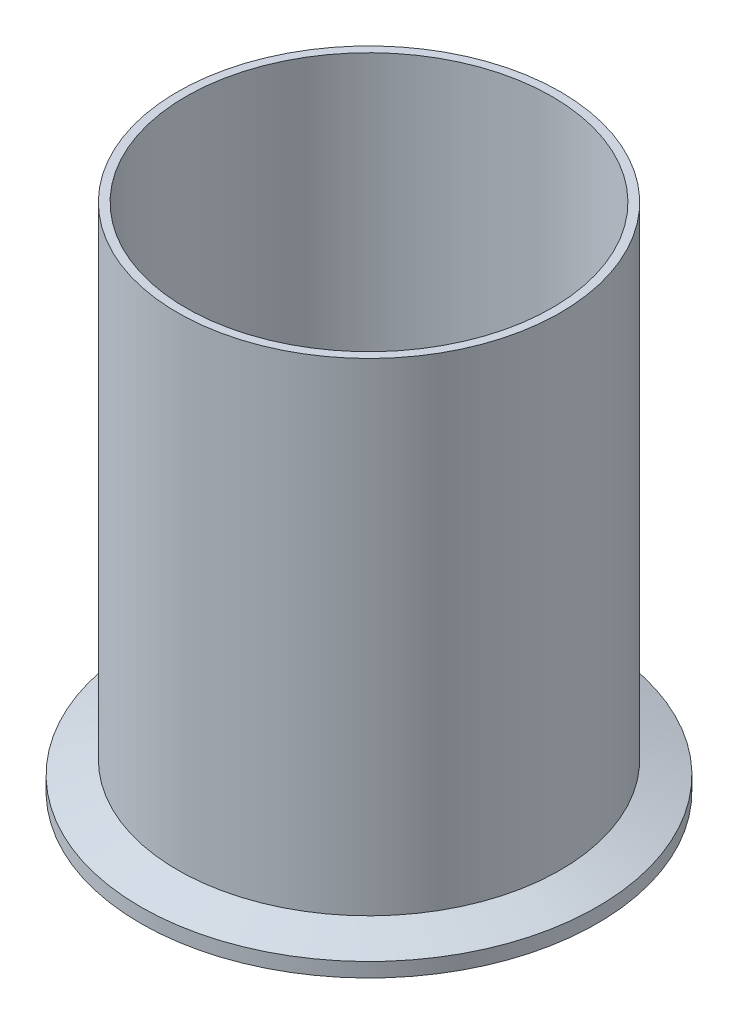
ISO-10303-21;
HEADER;
FILE_DESCRIPTION(('STEP AP214'),'2;1');
FILE_NAME('part.step','',(''),(''),'','','');
FILE_SCHEMA(('AUTOMOTIVE_DESIGN { 1 0 10303 214 1 1 1 1 }'));
ENDSEC;
DATA;
#1=APPLICATION_CONTEXT('core data for automotive mechanical design processes');
#2=APPLICATION_PROTOCOL_DEFINITION('international standard','automotive_design',2000,#1);
#3=PRODUCT_CONTEXT('',#1,'mechanical');
#4=PRODUCT('Part','Part','',(#3));
#5=PRODUCT_RELATED_PRODUCT_CATEGORY('part','',(#4));
#6=PRODUCT_DEFINITION_FORMATION('','',#4);
#7=PRODUCT_DEFINITION_CONTEXT('part definition',#1,'design');
#8=PRODUCT_DEFINITION('design','',#6,#7);
#9=PRODUCT_DEFINITION_SHAPE('','',#8);
#10=(LENGTH_UNIT() NAMED_UNIT(*) SI_UNIT(.MILLI.,.METRE.));
#11=(NAMED_UNIT(*) PLANE_ANGLE_UNIT() SI_UNIT($,.RADIAN.));
#12=(NAMED_UNIT(*) SI_UNIT($,.STERADIAN.) SOLID_ANGLE_UNIT());
#13=UNCERTAINTY_MEASURE_WITH_UNIT(LENGTH_MEASURE(1.E-05),#10,'distance_accuracy_value','');
#14=(GEOMETRIC_REPRESENTATION_CONTEXT(3) GLOBAL_UNCERTAINTY_ASSIGNED_CONTEXT((#13)) GLOBAL_UNIT_ASSIGNED_CONTEXT((#10,
#11,#12)) REPRESENTATION_CONTEXT('',''));
#15=CARTESIAN_POINT('',(0.,0.,0.));
#16=DIRECTION('',(0.,0.,1.));
#17=DIRECTION('',(1.,0.,0.));
#18=AXIS2_PLACEMENT_3D('',#15,#16,#17);
#19=CARTESIAN_POINT('',(0.,0.7874,0.));
#20=DIRECTION('',(0.,-1.,0.));
#21=DIRECTION('',(0.,0.,-1.));
#22=AXIS2_PLACEMENT_3D('',#19,#20,#21);
#23=TOROIDAL_SURFACE('',#22,43.4867084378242,0.787400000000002);
#24=CARTESIAN_POINT('',(0.,0.,0.));
#25=DIRECTION('',(0.,-1.,0.));
#26=DIRECTION('',(0.,0.,-1.));
#27=AXIS2_PLACEMENT_3D('',#24,#25,#26);
#28=CIRCLE('',#27,43.4867084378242);
#29=CARTESIAN_POINT('',(0.,0.,-43.4867084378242));
#30=VERTEX_POINT('',#29);
#31=EDGE_CURVE('E67',#30,#30,#28,.T.);
#32=ORIENTED_EDGE('',*,*,#31,.T.);
#33=EDGE_LOOP('',(#32));
#34=FACE_BOUND('',#33,.T.);
#35=CARTESIAN_POINT('',(0.,0.474458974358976,0.));
#36=DIRECTION('',(0.,-1.,0.));
#37=DIRECTION('',(0.,0.,-1.));
#38=AXIS2_PLACEMENT_3D('',#35,#36,#37);
#39=CIRCLE('',#38,42.7641666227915);
#40=CARTESIAN_POINT('',(0.,0.474458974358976,-42.7641666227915));
#41=VERTEX_POINT('',#40);
#42=EDGE_CURVE('E10',#41,#41,#39,.T.);
#43=ORIENTED_EDGE('',*,*,#42,.F.);
#44=EDGE_LOOP('',(#43));
#45=FACE_BOUND('',#44,.T.);
#46=ADVANCED_FACE('F33',(#34,#45),#23,.T.);
#47=CARTESIAN_POINT('',(0.,0.,0.));
#48=DIRECTION('',(0.,-1.,0.));
#49=DIRECTION('',(0.,0.,-1.));
#50=AXIS2_PLACEMENT_3D('',#47,#48,#49);
#51=TOROIDAL_SURFACE('',#50,41.6687,1.1938);
#52=CARTESIAN_POINT('',(0.,0.474458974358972,0.));
#53=DIRECTION('',(0.,-1.,0.));
#54=DIRECTION('',(0.,0.,-1.));
#55=AXIS2_PLACEMENT_3D('',#52,#53,#54);
#56=CIRCLE('',#55,40.5732333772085);
#57=CARTESIAN_POINT('',(0.,0.474458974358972,-40.5732333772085));
#58=VERTEX_POINT('',#57);
#59=EDGE_CURVE('E39',#58,#58,#56,.T.);
#60=ORIENTED_EDGE('',*,*,#59,.F.);
#61=EDGE_LOOP('',(#60));
#62=FACE_BOUND('',#61,.T.);
#63=ORIENTED_EDGE('',*,*,#42,.T.);
#64=EDGE_LOOP('',(#63));
#65=FACE_BOUND('',#64,.T.);
#66=ADVANCED_FACE('F115',(#62,#65),#51,.F.);
#67=CARTESIAN_POINT('',(0.,0.7874,0.));
#68=DIRECTION('',(0.,-1.,0.));
#69=DIRECTION('',(0.,0.,-1.));
#70=AXIS2_PLACEMENT_3D('',#67,#68,#69);
#71=TOROIDAL_SURFACE('',#70,39.8506915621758,0.787399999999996);
#72=ORIENTED_EDGE('',*,*,#59,.T.);
#73=EDGE_LOOP('',(#72));
#74=FACE_BOUND('',#73,.T.);
#75=CARTESIAN_POINT('',(0.,0.,0.));
#76=DIRECTION('',(0.,-1.,0.));
#77=DIRECTION('',(0.,0.,-1.));
#78=AXIS2_PLACEMENT_3D('',#75,#76,#77);
#79=CIRCLE('',#78,39.8506915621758);
#80=CARTESIAN_POINT('',(0.,0.,-39.8506915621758));
#81=VERTEX_POINT('',#80);
#82=EDGE_CURVE('E43',#81,#81,#79,.T.);
#83=ORIENTED_EDGE('',*,*,#82,.F.);
#84=EDGE_LOOP('',(#83));
#85=FACE_BOUND('',#84,.T.);
#86=ADVANCED_FACE('F111',(#74,#85),#71,.T.);
#87=CARTESIAN_POINT('',(0.,0.,0.));
#88=DIRECTION('',(0.,1.,0.));
#89=DIRECTION('',(0.,0.,1.));
#90=AXIS2_PLACEMENT_3D('',#87,#88,#89);
#91=PLANE('',#90);
#92=CARTESIAN_POINT('',(0.,0.,0.));
#93=DIRECTION('',(0.,-1.,0.));
#94=DIRECTION('',(0.,0.,-1.));
#95=AXIS2_PLACEMENT_3D('',#92,#93,#94);
#96=CIRCLE('',#95,36.449);
#97=CARTESIAN_POINT('',(0.,0.,-36.449));
#98=VERTEX_POINT('',#97);
#99=EDGE_CURVE('E47',#98,#98,#96,.T.);
#100=ORIENTED_EDGE('',*,*,#99,.F.);
#101=EDGE_LOOP('',(#100));
#102=FACE_BOUND('',#101,.T.);
#103=ORIENTED_EDGE('',*,*,#82,.T.);
#104=EDGE_LOOP('',(#103));
#105=FACE_BOUND('',#104,.T.);
#106=ADVANCED_FACE('F105',(#102,#105),#91,.F.);
#107=CARTESIAN_POINT('',(0.,0.,0.));
#108=DIRECTION('',(0.,-1.,0.));
#109=DIRECTION('',(0.,0.,-1.));
#110=AXIS2_PLACEMENT_3D('',#107,#108,#109);
#111=CYLINDRICAL_SURFACE('',#110,36.449);
#112=ORIENTED_EDGE('',*,*,#99,.T.);
#113=EDGE_LOOP('',(#112));
#114=FACE_BOUND('',#113,.T.);
#115=CARTESIAN_POINT('',(0.,101.6,0.));
#116=DIRECTION('',(0.,-1.,0.));
#117=DIRECTION('',(0.,0.,-1.));
#118=AXIS2_PLACEMENT_3D('',#115,#116,#117);
#119=CIRCLE('',#118,36.449);
#120=CARTESIAN_POINT('',(0.,101.6,-36.449));
#121=VERTEX_POINT('',#120);
#122=EDGE_CURVE('E52',#121,#121,#119,.T.);
#123=ORIENTED_EDGE('',*,*,#122,.F.);
#124=EDGE_LOOP('',(#123));
#125=FACE_BOUND('',#124,.T.);
#126=ADVANCED_FACE('F100',(#114,#125),#111,.F.);
#127=CARTESIAN_POINT('',(0.,101.6,0.));
#128=DIRECTION('',(0.,-1.,0.));
#129=DIRECTION('',(0.,0.,-1.));
#130=AXIS2_PLACEMENT_3D('',#127,#128,#129);
#131=PLANE('',#130);
#132=CARTESIAN_POINT('',(0.,101.6,0.));
#133=DIRECTION('',(0.,-1.,0.));
#134=DIRECTION('',(0.,0.,-1.));
#135=AXIS2_PLACEMENT_3D('',#132,#133,#134);
#136=CIRCLE('',#135,38.1);
#137=CARTESIAN_POINT('',(0.,101.6,-38.1));
#138=VERTEX_POINT('',#137);
#139=EDGE_CURVE('E55',#138,#138,#136,.T.);
#140=ORIENTED_EDGE('',*,*,#139,.F.);
#141=EDGE_LOOP('',(#140));
#142=FACE_BOUND('',#141,.T.);
#143=ORIENTED_EDGE('',*,*,#122,.T.);
#144=EDGE_LOOP('',(#143));
#145=FACE_BOUND('',#144,.T.);
#146=ADVANCED_FACE('F94',(#142,#145),#131,.F.);
#147=CARTESIAN_POINT('',(0.,0.,0.));
#148=DIRECTION('',(0.,-1.,0.));
#149=DIRECTION('',(0.,0.,-1.));
#150=AXIS2_PLACEMENT_3D('',#147,#148,#149);
#151=CYLINDRICAL_SURFACE('',#150,38.1);
#152=CARTESIAN_POINT('',(0.,5.52118232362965,0.));
#153=DIRECTION('',(0.,-1.,0.));
#154=DIRECTION('',(0.,0.,-1.));
#155=AXIS2_PLACEMENT_3D('',#152,#153,#154);
#156=CIRCLE('',#155,38.1);
#157=CARTESIAN_POINT('',(0.,5.52118232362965,-38.1));
#158=VERTEX_POINT('',#157);
#159=EDGE_CURVE('E58',#158,#158,#156,.T.);
#160=ORIENTED_EDGE('',*,*,#159,.F.);
#161=EDGE_LOOP('',(#160));
#162=FACE_BOUND('',#161,.T.);
#163=ORIENTED_EDGE('',*,*,#139,.T.);
#164=EDGE_LOOP('',(#163));
#165=FACE_BOUND('',#164,.T.);
#166=ADVANCED_FACE('F88',(#162,#165),#151,.T.);
#167=CARTESIAN_POINT('',(0.,5.52118232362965,0.));
#168=DIRECTION('',(0.,-1.,0.));
#169=DIRECTION('',(0.,0.,-1.));
#170=AXIS2_PLACEMENT_3D('',#167,#168,#169);
#171=CONICAL_SURFACE('',#170,38.1,1.22173047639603);
#172=CARTESIAN_POINT('',(0.,2.8448,0.));
#173=DIRECTION('',(0.,-1.,0.));
#174=DIRECTION('',(0.,0.,-1.));
#175=AXIS2_PLACEMENT_3D('',#172,#173,#174);
#176=CIRCLE('',#175,45.4533);
#177=CARTESIAN_POINT('',(0.,2.8448,-45.4533));
#178=VERTEX_POINT('',#177);
#179=EDGE_CURVE('E61',#178,#178,#176,.T.);
#180=ORIENTED_EDGE('',*,*,#179,.F.);
#181=EDGE_LOOP('',(#180));
#182=FACE_BOUND('',#181,.T.);
#183=ORIENTED_EDGE('',*,*,#159,.T.);
#184=EDGE_LOOP('',(#183));
#185=FACE_BOUND('',#184,.T.);
#186=ADVANCED_FACE('F82',(#182,#185),#171,.T.);
#187=CARTESIAN_POINT('',(0.,0.,0.));
#188=DIRECTION('',(0.,-1.,0.));
#189=DIRECTION('',(0.,0.,-1.));
#190=AXIS2_PLACEMENT_3D('',#187,#188,#189);
#191=CYLINDRICAL_SURFACE('',#190,45.4533);
#192=CARTESIAN_POINT('',(0.,0.,0.));
#193=DIRECTION('',(0.,-1.,0.));
#194=DIRECTION('',(0.,0.,-1.));
#195=AXIS2_PLACEMENT_3D('',#192,#193,#194);
#196=CIRCLE('',#195,45.4533);
#197=CARTESIAN_POINT('',(0.,0.,-45.4533));
#198=VERTEX_POINT('',#197);
#199=EDGE_CURVE('E64',#198,#198,#196,.T.);
#200=ORIENTED_EDGE('',*,*,#199,.F.);
#201=EDGE_LOOP('',(#200));
#202=FACE_BOUND('',#201,.T.);
#203=ORIENTED_EDGE('',*,*,#179,.T.);
#204=EDGE_LOOP('',(#203));
#205=FACE_BOUND('',#204,.T.);
#206=ADVANCED_FACE('F76',(#202,#205),#191,.T.);
#207=CARTESIAN_POINT('',(0.,0.,0.));
#208=DIRECTION('',(0.,1.,0.));
#209=DIRECTION('',(0.,0.,1.));
#210=AXIS2_PLACEMENT_3D('',#207,#208,#209);
#211=PLANE('',#210);
#212=ORIENTED_EDGE('',*,*,#31,.F.);
#213=EDGE_LOOP('',(#212));
#214=FACE_BOUND('',#213,.T.);
#215=ORIENTED_EDGE('',*,*,#199,.T.);
#216=EDGE_LOOP('',(#215));
#217=FACE_BOUND('',#216,.T.);
#218=ADVANCED_FACE('F73',(#214,#217),#211,.F.);
#219=CLOSED_SHELL('',(#46,#66,#86,#106,#126,#146,#166,#186,#206,#218));
#220=MANIFOLD_SOLID_BREP('B2',#219);
#221=ADVANCED_BREP_SHAPE_REPRESENTATION('',(#18,#220),#14);
#222=SHAPE_DEFINITION_REPRESENTATION(#9,#221);
ENDSEC;
END-ISO-10303-21;
